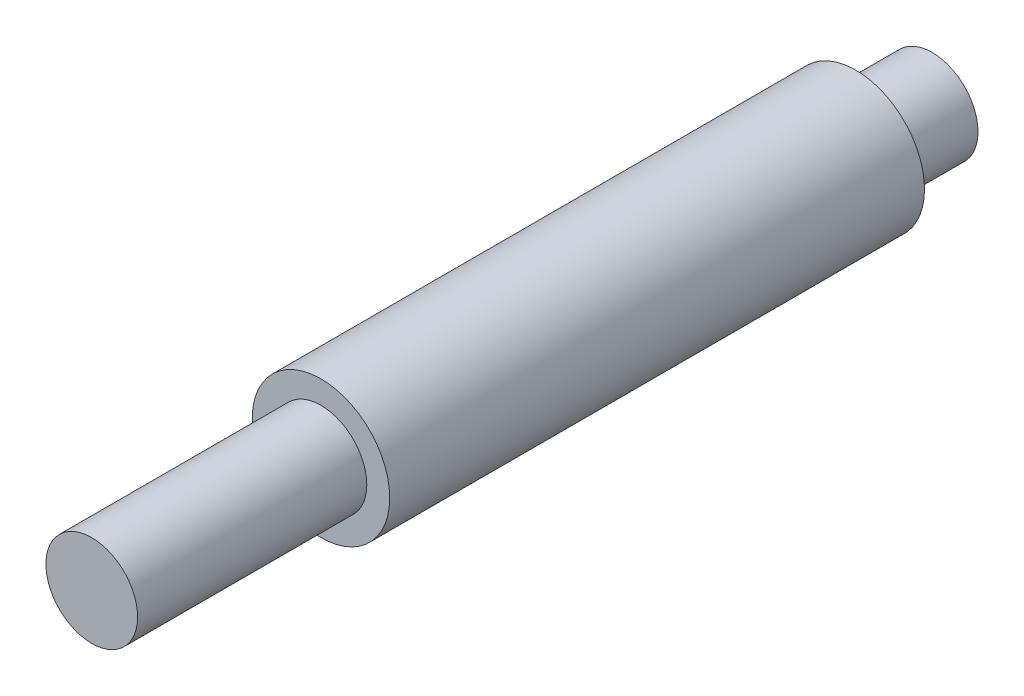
from build123d import *

# Parameters (mm, degrees)
SKETCH_1_R      = 6
EXTRUDE_1_DEPTH = 10
SKETCH_2_R      = 9
EXTRUDE_2_DEPTH = 70
SKETCH_3_R      = 6
EXTRUDE_3_DEPTH = 30


with BuildPart() as part:
    # Sketch 1 → Extrude 1 (new body)
    with BuildSketch(Plane.XY):
        Circle(SKETCH_1_R)
    extrude(amount=EXTRUDE_1_DEPTH)

    # Sketch 2 → Extrude 2 (add)
    with BuildSketch(Plane.XY.offset(10)):
        Circle(SKETCH_2_R)
    extrude(amount=EXTRUDE_2_DEPTH)

    # Sketch 3 → Extrude 3 (add)
    with BuildSketch(Plane.XY.offset(80)):
        Circle(SKETCH_3_R)
    extrude(amount=EXTRUDE_3_DEPTH)


solid = part.part
